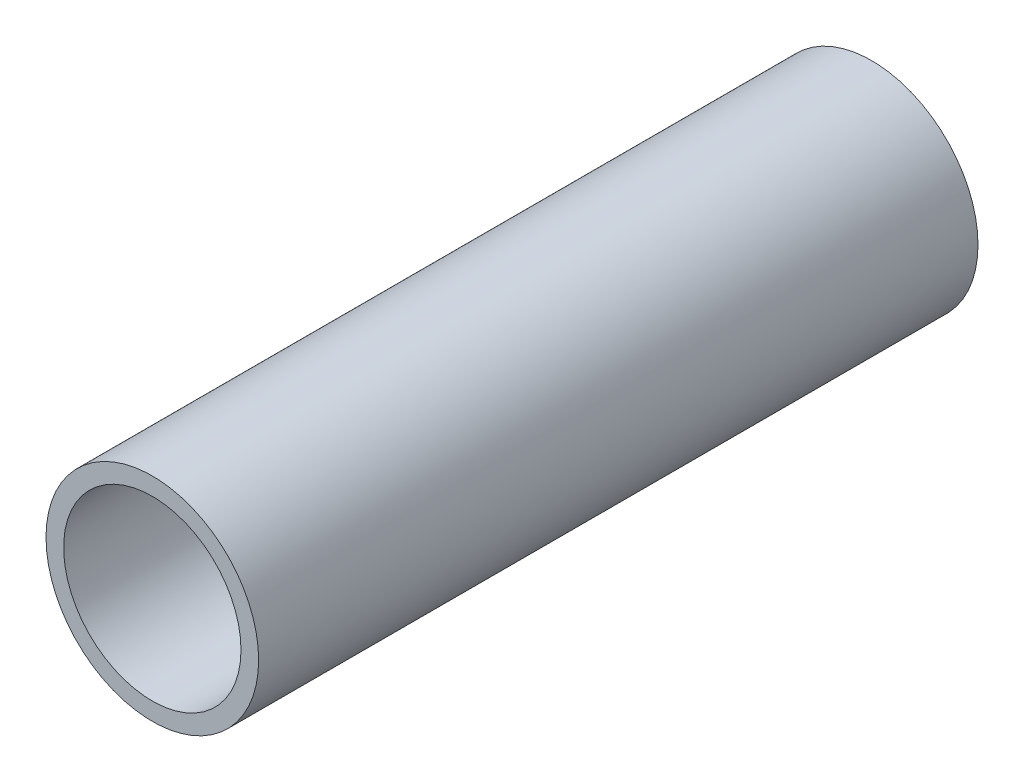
ISO-10303-21;
HEADER;
FILE_DESCRIPTION(('STEP AP214'),'2;1');
FILE_NAME('part.step','',(''),(''),'','','');
FILE_SCHEMA(('AUTOMOTIVE_DESIGN { 1 0 10303 214 1 1 1 1 }'));
ENDSEC;
DATA;
#1=APPLICATION_CONTEXT('core data for automotive mechanical design processes');
#2=APPLICATION_PROTOCOL_DEFINITION('international standard','automotive_design',2000,#1);
#3=PRODUCT_CONTEXT('',#1,'mechanical');
#4=PRODUCT('Part','Part','',(#3));
#5=PRODUCT_RELATED_PRODUCT_CATEGORY('part','',(#4));
#6=PRODUCT_DEFINITION_FORMATION('','',#4);
#7=PRODUCT_DEFINITION_CONTEXT('part definition',#1,'design');
#8=PRODUCT_DEFINITION('design','',#6,#7);
#9=PRODUCT_DEFINITION_SHAPE('','',#8);
#10=(LENGTH_UNIT() NAMED_UNIT(*) SI_UNIT(.MILLI.,.METRE.));
#11=(NAMED_UNIT(*) PLANE_ANGLE_UNIT() SI_UNIT($,.RADIAN.));
#12=(NAMED_UNIT(*) SI_UNIT($,.STERADIAN.) SOLID_ANGLE_UNIT());
#13=UNCERTAINTY_MEASURE_WITH_UNIT(LENGTH_MEASURE(1.E-05),#10,'distance_accuracy_value','');
#14=(GEOMETRIC_REPRESENTATION_CONTEXT(3) GLOBAL_UNCERTAINTY_ASSIGNED_CONTEXT((#13)) GLOBAL_UNIT_ASSIGNED_CONTEXT((#10,
#11,#12)) REPRESENTATION_CONTEXT('',''));
#15=CARTESIAN_POINT('',(0.,0.,0.));
#16=DIRECTION('',(0.,0.,1.));
#17=DIRECTION('',(1.,0.,0.));
#18=AXIS2_PLACEMENT_3D('',#15,#16,#17);
#19=CARTESIAN_POINT('',(0.,0.,204.));
#20=DIRECTION('',(0.,0.,1.));
#21=DIRECTION('',(1.,0.,0.));
#22=AXIS2_PLACEMENT_3D('',#19,#20,#21);
#23=PLANE('',#22);
#24=CARTESIAN_POINT('',(0.,0.,204.));
#25=DIRECTION('',(0.,0.,1.));
#26=DIRECTION('',(1.,0.,0.));
#27=AXIS2_PLACEMENT_3D('',#24,#25,#26);
#28=CIRCLE('',#27,25.15);
#29=CARTESIAN_POINT('',(25.15,0.,204.));
#30=VERTEX_POINT('',#29);
#31=EDGE_CURVE('E24',#30,#30,#28,.T.);
#32=ORIENTED_EDGE('',*,*,#31,.F.);
#33=EDGE_LOOP('',(#32));
#34=FACE_BOUND('',#33,.T.);
#35=CARTESIAN_POINT('',(0.,0.,204.));
#36=DIRECTION('',(0.,0.,1.));
#37=DIRECTION('',(1.,0.,0.));
#38=AXIS2_PLACEMENT_3D('',#35,#36,#37);
#39=CIRCLE('',#38,30.15);
#40=CARTESIAN_POINT('',(30.15,0.,204.));
#41=VERTEX_POINT('',#40);
#42=EDGE_CURVE('E57',#41,#41,#39,.T.);
#43=ORIENTED_EDGE('',*,*,#42,.T.);
#44=EDGE_LOOP('',(#43));
#45=FACE_BOUND('',#44,.T.);
#46=ADVANCED_FACE('F16',(#34,#45),#23,.T.);
#47=CARTESIAN_POINT('',(0.,0.,0.));
#48=DIRECTION('',(0.,0.,1.));
#49=DIRECTION('',(1.,0.,0.));
#50=AXIS2_PLACEMENT_3D('',#47,#48,#49);
#51=PLANE('',#50);
#52=CARTESIAN_POINT('',(0.,0.,0.));
#53=DIRECTION('',(0.,0.,1.));
#54=DIRECTION('',(1.,0.,0.));
#55=AXIS2_PLACEMENT_3D('',#52,#53,#54);
#56=CIRCLE('',#55,25.15);
#57=CARTESIAN_POINT('',(25.15,0.,0.));
#58=VERTEX_POINT('',#57);
#59=EDGE_CURVE('E10',#58,#58,#56,.T.);
#60=ORIENTED_EDGE('',*,*,#59,.T.);
#61=EDGE_LOOP('',(#60));
#62=FACE_BOUND('',#61,.T.);
#63=CARTESIAN_POINT('',(0.,0.,0.));
#64=DIRECTION('',(0.,0.,1.));
#65=DIRECTION('',(1.,0.,0.));
#66=AXIS2_PLACEMENT_3D('',#63,#64,#65);
#67=CIRCLE('',#66,30.15);
#68=CARTESIAN_POINT('',(30.15,0.,0.));
#69=VERTEX_POINT('',#68);
#70=EDGE_CURVE('E56',#69,#69,#67,.T.);
#71=ORIENTED_EDGE('',*,*,#70,.F.);
#72=EDGE_LOOP('',(#71));
#73=FACE_BOUND('',#72,.T.);
#74=ADVANCED_FACE('F88',(#62,#73),#51,.F.);
#75=CARTESIAN_POINT('',(0.,0.,0.));
#76=DIRECTION('',(0.,0.,-1.));
#77=DIRECTION('',(1.,0.,0.));
#78=AXIS2_PLACEMENT_3D('',#75,#76,#77);
#79=CYLINDRICAL_SURFACE('',#78,25.15);
#80=DIRECTION('',(0.,0.,1.));
#81=VECTOR('',#80,1.);
#82=CARTESIAN_POINT('',(25.15,0.,0.));
#83=LINE('',#82,#81);
#84=EDGE_CURVE('E64',#58,#30,#83,.T.);
#85=ORIENTED_EDGE('',*,*,#84,.T.);
#86=ORIENTED_EDGE('',*,*,#31,.T.);
#87=ORIENTED_EDGE('',*,*,#84,.F.);
#88=ORIENTED_EDGE('',*,*,#59,.F.);
#89=EDGE_LOOP('',(#85,#86,#87,#88));
#90=FACE_BOUND('',#89,.T.);
#91=ADVANCED_FACE('F79',(#90),#79,.F.);
#92=CARTESIAN_POINT('',(0.,0.,0.));
#93=DIRECTION('',(0.,0.,-1.));
#94=DIRECTION('',(1.,0.,0.));
#95=AXIS2_PLACEMENT_3D('',#92,#93,#94);
#96=CYLINDRICAL_SURFACE('',#95,30.15);
#97=ORIENTED_EDGE('',*,*,#70,.T.);
#98=DIRECTION('',(0.,0.,1.));
#99=VECTOR('',#98,1.);
#100=CARTESIAN_POINT('',(30.15,0.,0.));
#101=LINE('',#100,#99);
#102=EDGE_CURVE('E53',#69,#41,#101,.T.);
#103=ORIENTED_EDGE('',*,*,#102,.T.);
#104=ORIENTED_EDGE('',*,*,#42,.F.);
#105=ORIENTED_EDGE('',*,*,#102,.F.);
#106=EDGE_LOOP('',(#97,#103,#104,#105));
#107=FACE_BOUND('',#106,.T.);
#108=ADVANCED_FACE('F54',(#107),#96,.T.);
#109=CLOSED_SHELL('',(#46,#74,#91,#108));
#110=MANIFOLD_SOLID_BREP('B1',#109);
#111=ADVANCED_BREP_SHAPE_REPRESENTATION('',(#18,#110),#14);
#112=SHAPE_DEFINITION_REPRESENTATION(#9,#111);
ENDSEC;
END-ISO-10303-21;
